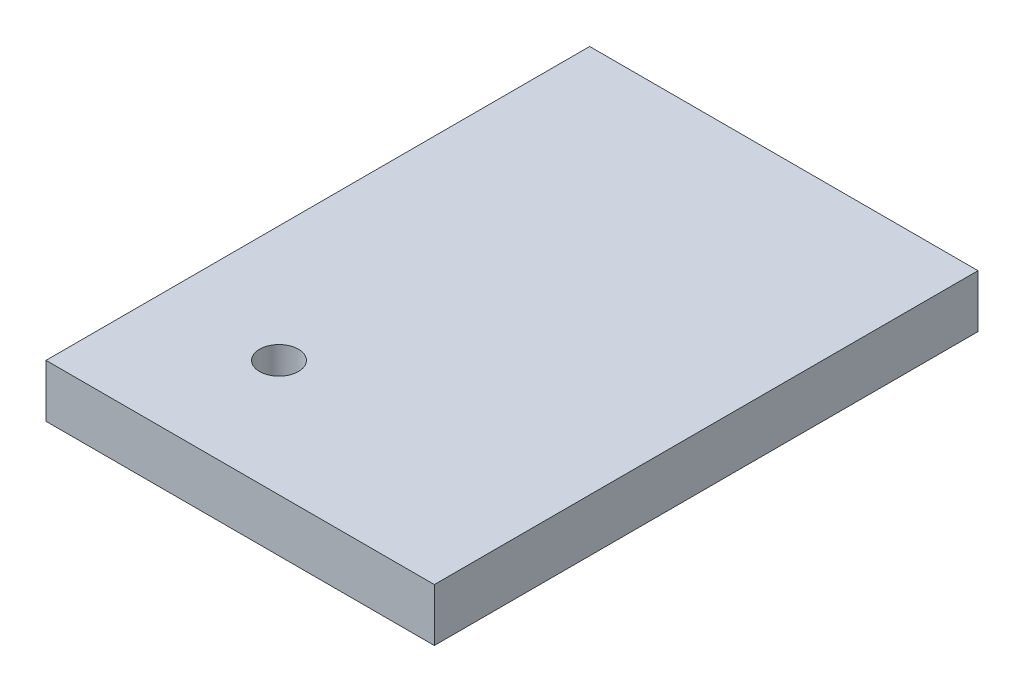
from build123d import *

# Parameters (mm, degrees)
SKETCH1_W          = 127
SKETCH1_H          = 177.8
EXTRUDE1_DEPTH     = 17.272
SKETCH2_R          = 6.35
CUT_EXTRUDE1_DEPTH = 111.606428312


with BuildPart() as part:
    # Sketch1 → Extrude1 (new body)
    with BuildSketch(Plane(origin=(0, 0, 0), x_dir=(1, 0, 0), z_dir=(0, 1, 0))):
        Rectangle(SKETCH1_W, SKETCH1_H)
    extrude(amount=EXTRUDE1_DEPTH)

    # Sketch2 → Cut-Extrude1 (cut, through all)
    with BuildSketch(Plane(origin=(0, 17.272, 0), x_dir=(1, 0, 0), z_dir=(0, 1, 0))):
        with Locations(Location((-25.4, -50.8, 0), (0, 0, 270))):
            Circle(SKETCH2_R)
    extrude(amount=-CUT_EXTRUDE1_DEPTH, mode=Mode.SUBTRACT)


solid = part.part
